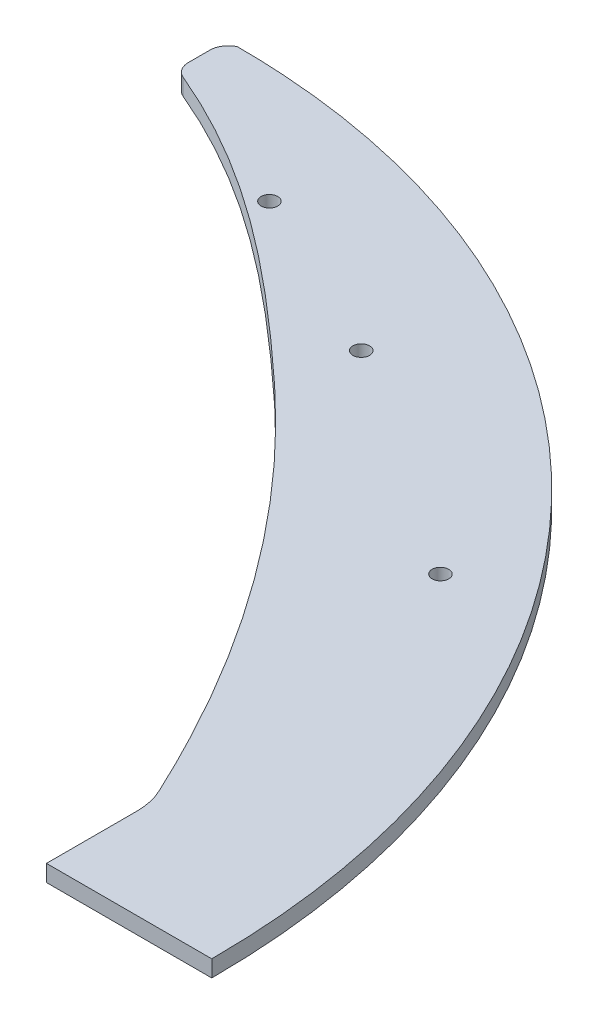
ISO-10303-21;
HEADER;
FILE_DESCRIPTION(('STEP AP214'),'2;1');
FILE_NAME('part.step','',(''),(''),'','','');
FILE_SCHEMA(('AUTOMOTIVE_DESIGN { 1 0 10303 214 1 1 1 1 }'));
ENDSEC;
DATA;
#1=APPLICATION_CONTEXT('core data for automotive mechanical design processes');
#2=APPLICATION_PROTOCOL_DEFINITION('international standard','automotive_design',2000,#1);
#3=PRODUCT_CONTEXT('',#1,'mechanical');
#4=PRODUCT('Part','Part','',(#3));
#5=PRODUCT_RELATED_PRODUCT_CATEGORY('part','',(#4));
#6=PRODUCT_DEFINITION_FORMATION('','',#4);
#7=PRODUCT_DEFINITION_CONTEXT('part definition',#1,'design');
#8=PRODUCT_DEFINITION('design','',#6,#7);
#9=PRODUCT_DEFINITION_SHAPE('','',#8);
#10=(LENGTH_UNIT() NAMED_UNIT(*) SI_UNIT(.MILLI.,.METRE.));
#11=(NAMED_UNIT(*) PLANE_ANGLE_UNIT() SI_UNIT($,.RADIAN.));
#12=(NAMED_UNIT(*) SI_UNIT($,.STERADIAN.) SOLID_ANGLE_UNIT());
#13=UNCERTAINTY_MEASURE_WITH_UNIT(LENGTH_MEASURE(1.E-05),#10,'distance_accuracy_value','');
#14=(GEOMETRIC_REPRESENTATION_CONTEXT(3) GLOBAL_UNCERTAINTY_ASSIGNED_CONTEXT((#13)) GLOBAL_UNIT_ASSIGNED_CONTEXT((#10,
#11,#12)) REPRESENTATION_CONTEXT('',''));
#15=CARTESIAN_POINT('',(0.,0.,0.));
#16=DIRECTION('',(0.,0.,1.));
#17=DIRECTION('',(1.,0.,0.));
#18=AXIS2_PLACEMENT_3D('',#15,#16,#17);
#19=CARTESIAN_POINT('',(-284.393197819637,6.35,-281.299037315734));
#20=CARTESIAN_POINT('',(-285.021622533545,6.35,-280.770880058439));
#21=CARTESIAN_POINT('',(-285.648490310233,6.35,-280.214344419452));
#22=CARTESIAN_POINT('',(-286.273725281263,6.35,-279.628692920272));
#23=B_SPLINE_CURVE_WITH_KNOTS('',3,(#19,#20,#21,#22),.UNSPECIFIED.,.F.,.F.,(4,4),
(0.923259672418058,0.930191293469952),.UNSPECIFIED.);
#24=DIRECTION('',(0.,-1.,0.));
#25=VECTOR('',#24,1.);
#26=SURFACE_OF_LINEAR_EXTRUSION('',#23,#25);
#27=CARTESIAN_POINT('',(-284.393197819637,0.,-281.299037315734));
#28=CARTESIAN_POINT('',(-285.021622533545,0.,-280.770880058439));
#29=CARTESIAN_POINT('',(-285.648490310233,0.,-280.214344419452));
#30=CARTESIAN_POINT('',(-286.273725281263,0.,-279.628692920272));
#31=B_SPLINE_CURVE_WITH_KNOTS('',3,(#27,#28,#29,#30),.UNSPECIFIED.,.F.,.F.,(4,4),
(0.923259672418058,0.930191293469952),.UNSPECIFIED.);
#32=CARTESIAN_POINT('',(-284.393197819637,0.,-281.299037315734));
#33=VERTEX_POINT('',#32);
#34=CARTESIAN_POINT('',(-286.273725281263,0.,-279.628692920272));
#35=VERTEX_POINT('',#34);
#36=EDGE_CURVE('E135',#33,#35,#31,.T.);
#37=ORIENTED_EDGE('',*,*,#36,.T.);
#38=DIRECTION('',(0.,-1.,0.));
#39=VECTOR('',#38,1.);
#40=CARTESIAN_POINT('',(-286.273725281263,6.35,-279.628692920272));
#41=LINE('',#40,#39);
#42=CARTESIAN_POINT('',(-286.273725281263,6.35,-279.628692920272));
#43=VERTEX_POINT('',#42);
#44=EDGE_CURVE('E11',#43,#35,#41,.T.);
#45=ORIENTED_EDGE('',*,*,#44,.F.);
#46=CARTESIAN_POINT('',(-284.393197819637,6.35,-281.299037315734));
#47=VERTEX_POINT('',#46);
#48=EDGE_CURVE('E173',#47,#43,#23,.T.);
#49=ORIENTED_EDGE('',*,*,#48,.F.);
#50=DIRECTION('',(0.,-1.,0.));
#51=VECTOR('',#50,1.);
#52=CARTESIAN_POINT('',(-284.393197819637,6.35,-281.299037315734));
#53=LINE('',#52,#51);
#54=EDGE_CURVE('E130',#47,#33,#53,.T.);
#55=ORIENTED_EDGE('',*,*,#54,.T.);
#56=EDGE_LOOP('',(#37,#45,#49,#55));
#57=FACE_BOUND('',#56,.T.);
#58=ADVANCED_FACE('F31',(#57),#26,.F.);
#59=CARTESIAN_POINT('',(-281.9326968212,6.35,-274.994259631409));
#60=DIRECTION('',(0.,-1.,0.));
#61=DIRECTION('',(0.,0.,-1.));
#62=AXIS2_PLACEMENT_3D('',#59,#60,#61);
#63=CYLINDRICAL_SURFACE('',#62,6.35);
#64=CARTESIAN_POINT('',(-281.9326968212,0.,-274.994259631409));
#65=DIRECTION('',(0.,1.,0.));
#66=DIRECTION('',(0.,0.,1.));
#67=AXIS2_PLACEMENT_3D('',#64,#65,#66);
#68=CIRCLE('',#67,6.35);
#69=CARTESIAN_POINT('',(-288.2826968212,0.,-274.994259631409));
#70=VERTEX_POINT('',#69);
#71=EDGE_CURVE('E238',#35,#70,#68,.T.);
#72=ORIENTED_EDGE('',*,*,#71,.T.);
#73=DIRECTION('',(0.,-1.,0.));
#74=VECTOR('',#73,1.);
#75=CARTESIAN_POINT('',(-288.2826968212,6.35,-274.994259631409));
#76=LINE('',#75,#74);
#77=CARTESIAN_POINT('',(-288.2826968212,6.35,-274.994259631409));
#78=VERTEX_POINT('',#77);
#79=EDGE_CURVE('E40',#78,#70,#76,.T.);
#80=ORIENTED_EDGE('',*,*,#79,.F.);
#81=CARTESIAN_POINT('',(-281.9326968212,6.35,-274.994259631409));
#82=DIRECTION('',(0.,1.,0.));
#83=DIRECTION('',(0.,0.,1.));
#84=AXIS2_PLACEMENT_3D('',#81,#82,#83);
#85=CIRCLE('',#84,6.35);
#86=EDGE_CURVE('E93',#43,#78,#85,.T.);
#87=ORIENTED_EDGE('',*,*,#86,.F.);
#88=ORIENTED_EDGE('',*,*,#44,.T.);
#89=EDGE_LOOP('',(#72,#80,#87,#88));
#90=FACE_BOUND('',#89,.T.);
#91=ADVANCED_FACE('F227',(#90),#63,.T.);
#92=CARTESIAN_POINT('',(-288.2826968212,6.35,-266.670639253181));
#93=DIRECTION('',(1.,0.,0.));
#94=DIRECTION('',(0.,0.,-1.));
#95=AXIS2_PLACEMENT_3D('',#92,#93,#94);
#96=PLANE('',#95);
#97=DIRECTION('',(0.,0.,1.));
#98=VECTOR('',#97,1.);
#99=CARTESIAN_POINT('',(-288.2826968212,0.,-266.670639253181));
#100=LINE('',#99,#98);
#101=CARTESIAN_POINT('',(-288.2826968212,0.,-266.670639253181));
#102=VERTEX_POINT('',#101);
#103=EDGE_CURVE('E239',#70,#102,#100,.T.);
#104=ORIENTED_EDGE('',*,*,#103,.T.);
#105=DIRECTION('',(0.,-1.,0.));
#106=VECTOR('',#105,1.);
#107=CARTESIAN_POINT('',(-288.2826968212,6.35,-266.670639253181));
#108=LINE('',#107,#106);
#109=CARTESIAN_POINT('',(-288.2826968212,6.35,-266.670639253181));
#110=VERTEX_POINT('',#109);
#111=EDGE_CURVE('E266',#110,#102,#108,.T.);
#112=ORIENTED_EDGE('',*,*,#111,.F.);
#113=DIRECTION('',(0.,0.,1.));
#114=VECTOR('',#113,1.);
#115=CARTESIAN_POINT('',(-288.2826968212,6.35,-266.670639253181));
#116=LINE('',#115,#114);
#117=EDGE_CURVE('E171',#78,#110,#116,.T.);
#118=ORIENTED_EDGE('',*,*,#117,.F.);
#119=ORIENTED_EDGE('',*,*,#79,.T.);
#120=EDGE_LOOP('',(#104,#112,#118,#119));
#121=FACE_BOUND('',#120,.T.);
#122=ADVANCED_FACE('F232',(#121),#96,.F.);
#123=CARTESIAN_POINT('',(-281.9326968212,6.35,-266.670639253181));
#124=DIRECTION('',(0.,-1.,0.));
#125=DIRECTION('',(0.,0.,-1.));
#126=AXIS2_PLACEMENT_3D('',#123,#124,#125);
#127=CYLINDRICAL_SURFACE('',#126,6.35);
#128=CARTESIAN_POINT('',(-281.9326968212,0.,-266.670639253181));
#129=DIRECTION('',(0.,1.,0.));
#130=DIRECTION('',(0.,0.,-1.));
#131=AXIS2_PLACEMENT_3D('',#128,#129,#130);
#132=CIRCLE('',#131,6.35);
#133=CARTESIAN_POINT('',(-284.393197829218,0.,-260.816714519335));
#134=VERTEX_POINT('',#133);
#135=EDGE_CURVE('E241',#102,#134,#132,.T.);
#136=ORIENTED_EDGE('',*,*,#135,.T.);
#137=DIRECTION('',(0.,-1.,0.));
#138=VECTOR('',#137,1.);
#139=CARTESIAN_POINT('',(-284.393197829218,6.35,-260.816714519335));
#140=LINE('',#139,#138);
#141=CARTESIAN_POINT('',(-284.393197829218,6.35,-260.816714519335));
#142=VERTEX_POINT('',#141);
#143=EDGE_CURVE('E263',#142,#134,#140,.T.);
#144=ORIENTED_EDGE('',*,*,#143,.F.);
#145=CARTESIAN_POINT('',(-281.9326968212,6.35,-266.670639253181));
#146=DIRECTION('',(0.,1.,0.));
#147=DIRECTION('',(0.,0.,-1.));
#148=AXIS2_PLACEMENT_3D('',#145,#146,#147);
#149=CIRCLE('',#148,6.35);
#150=EDGE_CURVE('E166',#110,#142,#149,.T.);
#151=ORIENTED_EDGE('',*,*,#150,.F.);
#152=ORIENTED_EDGE('',*,*,#111,.T.);
#153=EDGE_LOOP('',(#136,#144,#151,#152));
#154=FACE_BOUND('',#153,.T.);
#155=ADVANCED_FACE('F158',(#154),#127,.T.);
#156=CARTESIAN_POINT('',(-284.393197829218,6.35,-260.816714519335));
#157=CARTESIAN_POINT('',(-243.72979105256,6.35,-243.725214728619));
#158=CARTESIAN_POINT('',(-201.534298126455,6.35,-210.049484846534));
#159=CARTESIAN_POINT('',(-119.663104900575,6.35,-134.815986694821));
#160=CARTESIAN_POINT('',(-79.099570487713,6.35,-76.2755602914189));
#161=CARTESIAN_POINT('',(-52.7979241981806,6.35,-19.9194328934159));
#162=B_SPLINE_CURVE_WITH_KNOTS('',3,(#156,#157,#158,#159,#160,#161),.UNSPECIFIED.,.F.,.F.,(4,1,
1,4),(0.0154528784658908,0.380289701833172,0.477654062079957,0.989096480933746),.UNSPECIFIED.);
#163=DIRECTION('',(0.,-1.,0.));
#164=VECTOR('',#163,1.);
#165=SURFACE_OF_LINEAR_EXTRUSION('',#162,#164);
#166=CARTESIAN_POINT('',(-284.393197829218,0.,-260.816714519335));
#167=CARTESIAN_POINT('',(-243.72979105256,0.,-243.725214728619));
#168=CARTESIAN_POINT('',(-201.534298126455,0.,-210.049484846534));
#169=CARTESIAN_POINT('',(-119.663104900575,0.,-134.815986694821));
#170=CARTESIAN_POINT('',(-79.099570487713,0.,-76.2755602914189));
#171=CARTESIAN_POINT('',(-52.7979241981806,0.,-19.9194328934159));
#172=B_SPLINE_CURVE_WITH_KNOTS('',3,(#166,#167,#168,#169,#170,#171),.UNSPECIFIED.,.F.,.F.,(4,1,
1,4),(0.0154528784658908,0.380289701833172,0.477654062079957,0.989096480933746),.UNSPECIFIED.);
#173=CARTESIAN_POINT('',(-52.7979241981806,0.,-19.9194328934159));
#174=VERTEX_POINT('',#173);
#175=EDGE_CURVE('E245',#134,#174,#172,.T.);
#176=ORIENTED_EDGE('',*,*,#175,.T.);
#177=DIRECTION('',(0.,-1.,0.));
#178=VECTOR('',#177,1.);
#179=CARTESIAN_POINT('',(-52.7979241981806,6.35,-19.9194328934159));
#180=LINE('',#179,#178);
#181=CARTESIAN_POINT('',(-52.7979241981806,6.35,-19.9194328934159));
#182=VERTEX_POINT('',#181);
#183=EDGE_CURVE('E260',#182,#174,#180,.T.);
#184=ORIENTED_EDGE('',*,*,#183,.F.);
#185=EDGE_CURVE('E161',#142,#182,#162,.T.);
#186=ORIENTED_EDGE('',*,*,#185,.F.);
#187=ORIENTED_EDGE('',*,*,#143,.T.);
#188=EDGE_LOOP('',(#176,#184,#186,#187));
#189=FACE_BOUND('',#188,.T.);
#190=ADVANCED_FACE('F153',(#189),#165,.F.);
#191=CARTESIAN_POINT('',(-75.8146441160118,6.35,-9.17743102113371));
#192=DIRECTION('',(0.,-1.,0.));
#193=DIRECTION('',(0.,0.,-1.));
#194=AXIS2_PLACEMENT_3D('',#191,#192,#193);
#195=CYLINDRICAL_SURFACE('',#194,25.4);
#196=CARTESIAN_POINT('',(-75.8146441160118,0.,-9.17743102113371));
#197=DIRECTION('',(0.,-1.,0.));
#198=DIRECTION('',(0.,0.,1.));
#199=AXIS2_PLACEMENT_3D('',#196,#197,#198);
#200=CIRCLE('',#199,25.4);
#201=CARTESIAN_POINT('',(-50.4146441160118,0.,-9.17743102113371));
#202=VERTEX_POINT('',#201);
#203=EDGE_CURVE('E249',#174,#202,#200,.T.);
#204=ORIENTED_EDGE('',*,*,#203,.T.);
#205=DIRECTION('',(0.,-1.,0.));
#206=VECTOR('',#205,1.);
#207=CARTESIAN_POINT('',(-50.4146441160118,6.35,-9.17743102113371));
#208=LINE('',#207,#206);
#209=CARTESIAN_POINT('',(-50.4146441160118,6.35,-9.17743102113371));
#210=VERTEX_POINT('',#209);
#211=EDGE_CURVE('E125',#210,#202,#208,.T.);
#212=ORIENTED_EDGE('',*,*,#211,.F.);
#213=CARTESIAN_POINT('',(-75.8146441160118,6.35,-9.17743102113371));
#214=DIRECTION('',(0.,-1.,0.));
#215=DIRECTION('',(0.,0.,1.));
#216=AXIS2_PLACEMENT_3D('',#213,#214,#215);
#217=CIRCLE('',#216,25.4);
#218=EDGE_CURVE('E115',#182,#210,#217,.T.);
#219=ORIENTED_EDGE('',*,*,#218,.F.);
#220=ORIENTED_EDGE('',*,*,#183,.T.);
#221=EDGE_LOOP('',(#204,#212,#219,#220));
#222=FACE_BOUND('',#221,.T.);
#223=ADVANCED_FACE('F150',(#222),#195,.F.);
#224=CARTESIAN_POINT('',(-50.4146441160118,6.35,-9.17743102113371));
#225=DIRECTION('',(1.,0.,0.));
#226=DIRECTION('',(0.,0.,-1.));
#227=AXIS2_PLACEMENT_3D('',#224,#225,#226);
#228=PLANE('',#227);
#229=DIRECTION('',(0.,0.,1.));
#230=VECTOR('',#229,1.);
#231=CARTESIAN_POINT('',(-50.4146441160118,0.,-9.17743102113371));
#232=LINE('',#231,#230);
#233=CARTESIAN_POINT('',(-50.4146441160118,0.,25.403057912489));
#234=VERTEX_POINT('',#233);
#235=EDGE_CURVE('E124',#202,#234,#232,.T.);
#236=ORIENTED_EDGE('',*,*,#235,.T.);
#237=DIRECTION('',(0.,-1.,0.));
#238=VECTOR('',#237,1.);
#239=CARTESIAN_POINT('',(-50.4146441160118,6.35,25.403057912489));
#240=LINE('',#239,#238);
#241=CARTESIAN_POINT('',(-50.4146441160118,6.35,25.403057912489));
#242=VERTEX_POINT('',#241);
#243=EDGE_CURVE('E121',#242,#234,#240,.T.);
#244=ORIENTED_EDGE('',*,*,#243,.F.);
#245=DIRECTION('',(0.,0.,1.));
#246=VECTOR('',#245,1.);
#247=CARTESIAN_POINT('',(-50.4146441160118,6.35,-9.17743102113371));
#248=LINE('',#247,#246);
#249=EDGE_CURVE('E109',#210,#242,#248,.T.);
#250=ORIENTED_EDGE('',*,*,#249,.F.);
#251=ORIENTED_EDGE('',*,*,#211,.T.);
#252=EDGE_LOOP('',(#236,#244,#250,#251));
#253=FACE_BOUND('',#252,.T.);
#254=ADVANCED_FACE('F122',(#253),#228,.F.);
#255=CARTESIAN_POINT('',(-12.6572245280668,6.35,25.403057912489));
#256=DIRECTION('',(0.,0.,-1.));
#257=DIRECTION('',(-1.,0.,0.));
#258=AXIS2_PLACEMENT_3D('',#255,#256,#257);
#259=PLANE('',#258);
#260=DIRECTION('',(1.,0.,0.));
#261=VECTOR('',#260,1.);
#262=CARTESIAN_POINT('',(-12.6572245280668,0.,25.403057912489));
#263=LINE('',#262,#261);
#264=CARTESIAN_POINT('',(12.7501824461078,0.,25.403057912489));
#265=VERTEX_POINT('',#264);
#266=EDGE_CURVE('E79',#234,#265,#263,.T.);
#267=ORIENTED_EDGE('',*,*,#266,.T.);
#268=DIRECTION('',(0.,-1.,0.));
#269=VECTOR('',#268,1.);
#270=CARTESIAN_POINT('',(12.7501824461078,6.35,25.403057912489));
#271=LINE('',#270,#269);
#272=CARTESIAN_POINT('',(12.7501824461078,6.35,25.403057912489));
#273=VERTEX_POINT('',#272);
#274=EDGE_CURVE('E126',#273,#265,#271,.T.);
#275=ORIENTED_EDGE('',*,*,#274,.F.);
#276=DIRECTION('',(1.,0.,0.));
#277=VECTOR('',#276,1.);
#278=CARTESIAN_POINT('',(-50.4146441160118,6.35,25.403057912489));
#279=LINE('',#278,#277);
#280=EDGE_CURVE('E113',#242,#273,#279,.T.);
#281=ORIENTED_EDGE('',*,*,#280,.F.);
#282=ORIENTED_EDGE('',*,*,#243,.T.);
#283=EDGE_LOOP('',(#267,#275,#281,#282));
#284=FACE_BOUND('',#283,.T.);
#285=ADVANCED_FACE('F128',(#284),#259,.F.);
#286=CARTESIAN_POINT('',(-284.393197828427,6.35,25.4030579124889));
#287=DIRECTION('',(0.,1.,0.));
#288=DIRECTION('',(0.,0.,-1.));
#289=AXIS2_PLACEMENT_3D('',#286,#287,#288);
#290=ELLIPSE('',#289,306.702095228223,297.143380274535);
#291=DIRECTION('',(0.,-1.,0.));
#292=VECTOR('',#291,1.);
#293=SURFACE_OF_LINEAR_EXTRUSION('',#290,#292);
#294=CARTESIAN_POINT('',(-284.393197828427,0.,25.4030579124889));
#295=DIRECTION('',(0.,1.,0.));
#296=DIRECTION('',(0.,0.,-1.));
#297=AXIS2_PLACEMENT_3D('',#294,#295,#296);
#298=ELLIPSE('',#297,306.702095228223,297.143380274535);
#299=EDGE_CURVE('E85',#265,#33,#298,.T.);
#300=ORIENTED_EDGE('',*,*,#299,.T.);
#301=ORIENTED_EDGE('',*,*,#54,.F.);
#302=EDGE_CURVE('E48',#273,#47,#290,.T.);
#303=ORIENTED_EDGE('',*,*,#302,.F.);
#304=ORIENTED_EDGE('',*,*,#274,.T.);
#305=EDGE_LOOP('',(#300,#301,#303,#304));
#306=FACE_BOUND('',#305,.T.);
#307=ADVANCED_FACE('F140',(#306),#293,.F.);
#308=CARTESIAN_POINT('',(-285.334657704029,6.35,-280.48542545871));
#309=DIRECTION('',(0.,-1.,0.));
#310=DIRECTION('',(0.,0.,-1.));
#311=AXIS2_PLACEMENT_3D('',#308,#309,#310);
#312=PLANE('',#311);
#313=CARTESIAN_POINT('',(-226.891855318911,6.35,-236.255776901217));
#314=DIRECTION('',(0.,1.,0.));
#315=DIRECTION('',(0.,0.,1.));
#316=AXIS2_PLACEMENT_3D('',#313,#314,#315);
#317=CIRCLE('',#316,3.18135000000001);
#318=CARTESIAN_POINT('',(-226.891855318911,6.35,-233.074426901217));
#319=VERTEX_POINT('',#318);
#320=EDGE_CURVE('E194',#319,#319,#317,.T.);
#321=ORIENTED_EDGE('',*,*,#320,.F.);
#322=EDGE_LOOP('',(#321));
#323=FACE_BOUND('',#322,.T.);
#324=CARTESIAN_POINT('',(-159.936390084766,6.35,-204.38643865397));
#325=DIRECTION('',(0.,1.,0.));
#326=DIRECTION('',(0.,0.,1.));
#327=AXIS2_PLACEMENT_3D('',#324,#325,#326);
#328=CIRCLE('',#327,3.18135000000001);
#329=CARTESIAN_POINT('',(-159.936390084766,6.35,-201.20508865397));
#330=VERTEX_POINT('',#329);
#331=EDGE_CURVE('E188',#330,#330,#328,.T.);
#332=ORIENTED_EDGE('',*,*,#331,.F.);
#333=EDGE_LOOP('',(#332));
#334=FACE_BOUND('',#333,.T.);
#335=CARTESIAN_POINT('',(-70.8638343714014,6.35,-145.5785908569));
#336=DIRECTION('',(0.,1.,0.));
#337=DIRECTION('',(0.,0.,1.));
#338=AXIS2_PLACEMENT_3D('',#335,#336,#337);
#339=CIRCLE('',#338,3.18135);
#340=CARTESIAN_POINT('',(-70.8638343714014,6.35,-142.3972408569));
#341=VERTEX_POINT('',#340);
#342=EDGE_CURVE('E178',#341,#341,#339,.T.);
#343=ORIENTED_EDGE('',*,*,#342,.F.);
#344=EDGE_LOOP('',(#343));
#345=FACE_BOUND('',#344,.T.);
#346=ORIENTED_EDGE('',*,*,#48,.T.);
#347=ORIENTED_EDGE('',*,*,#86,.T.);
#348=ORIENTED_EDGE('',*,*,#117,.T.);
#349=ORIENTED_EDGE('',*,*,#150,.T.);
#350=ORIENTED_EDGE('',*,*,#185,.T.);
#351=ORIENTED_EDGE('',*,*,#218,.T.);
#352=ORIENTED_EDGE('',*,*,#249,.T.);
#353=ORIENTED_EDGE('',*,*,#280,.T.);
#354=ORIENTED_EDGE('',*,*,#302,.T.);
#355=EDGE_LOOP('',(#346,#347,#348,#349,#350,#351,#352,#353,#354));
#356=FACE_BOUND('',#355,.T.);
#357=ADVANCED_FACE('F111',(#323,#334,#345,#356),#312,.F.);
#358=CARTESIAN_POINT('',(-285.334657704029,0.,-280.48542545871));
#359=DIRECTION('',(0.,-1.,0.));
#360=DIRECTION('',(0.,0.,-1.));
#361=AXIS2_PLACEMENT_3D('',#358,#359,#360);
#362=PLANE('',#361);
#363=CARTESIAN_POINT('',(-226.891855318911,0.,-236.255776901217));
#364=DIRECTION('',(0.,1.,0.));
#365=DIRECTION('',(0.,0.,1.));
#366=AXIS2_PLACEMENT_3D('',#363,#364,#365);
#367=CIRCLE('',#366,3.18135000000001);
#368=CARTESIAN_POINT('',(-226.891855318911,0.,-233.074426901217));
#369=VERTEX_POINT('',#368);
#370=EDGE_CURVE('E191',#369,#369,#367,.T.);
#371=ORIENTED_EDGE('',*,*,#370,.T.);
#372=EDGE_LOOP('',(#371));
#373=FACE_BOUND('',#372,.T.);
#374=CARTESIAN_POINT('',(-159.936390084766,0.,-204.38643865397));
#375=DIRECTION('',(0.,1.,0.));
#376=DIRECTION('',(0.,0.,1.));
#377=AXIS2_PLACEMENT_3D('',#374,#375,#376);
#378=CIRCLE('',#377,3.18135000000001);
#379=CARTESIAN_POINT('',(-159.936390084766,0.,-201.20508865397));
#380=VERTEX_POINT('',#379);
#381=EDGE_CURVE('E185',#380,#380,#378,.T.);
#382=ORIENTED_EDGE('',*,*,#381,.T.);
#383=EDGE_LOOP('',(#382));
#384=FACE_BOUND('',#383,.T.);
#385=CARTESIAN_POINT('',(-70.8638343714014,0.,-145.5785908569));
#386=DIRECTION('',(0.,1.,0.));
#387=DIRECTION('',(0.,0.,1.));
#388=AXIS2_PLACEMENT_3D('',#385,#386,#387);
#389=CIRCLE('',#388,3.18135);
#390=CARTESIAN_POINT('',(-70.8638343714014,0.,-142.3972408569));
#391=VERTEX_POINT('',#390);
#392=EDGE_CURVE('E184',#391,#391,#389,.T.);
#393=ORIENTED_EDGE('',*,*,#392,.T.);
#394=EDGE_LOOP('',(#393));
#395=FACE_BOUND('',#394,.T.);
#396=ORIENTED_EDGE('',*,*,#36,.F.);
#397=ORIENTED_EDGE('',*,*,#299,.F.);
#398=ORIENTED_EDGE('',*,*,#266,.F.);
#399=ORIENTED_EDGE('',*,*,#235,.F.);
#400=ORIENTED_EDGE('',*,*,#203,.F.);
#401=ORIENTED_EDGE('',*,*,#175,.F.);
#402=ORIENTED_EDGE('',*,*,#135,.F.);
#403=ORIENTED_EDGE('',*,*,#103,.F.);
#404=ORIENTED_EDGE('',*,*,#71,.F.);
#405=EDGE_LOOP('',(#396,#397,#398,#399,#400,#401,#402,#403,#404));
#406=FACE_BOUND('',#405,.T.);
#407=ADVANCED_FACE('F144',(#373,#384,#395,#406),#362,.T.);
#408=CARTESIAN_POINT('',(-70.8638343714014,0.,-145.5785908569));
#409=DIRECTION('',(0.,1.,0.));
#410=DIRECTION('',(0.,0.,1.));
#411=AXIS2_PLACEMENT_3D('',#408,#409,#410);
#412=CYLINDRICAL_SURFACE('',#411,3.18135);
#413=ORIENTED_EDGE('',*,*,#392,.F.);
#414=EDGE_LOOP('',(#413));
#415=FACE_BOUND('',#414,.T.);
#416=ORIENTED_EDGE('',*,*,#342,.T.);
#417=EDGE_LOOP('',(#416));
#418=FACE_BOUND('',#417,.T.);
#419=ADVANCED_FACE('F215',(#415,#418),#412,.F.);
#420=CARTESIAN_POINT('',(-159.936390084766,0.,-204.38643865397));
#421=DIRECTION('',(0.,1.,0.));
#422=DIRECTION('',(0.,0.,1.));
#423=AXIS2_PLACEMENT_3D('',#420,#421,#422);
#424=CYLINDRICAL_SURFACE('',#423,3.18135000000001);
#425=ORIENTED_EDGE('',*,*,#381,.F.);
#426=EDGE_LOOP('',(#425));
#427=FACE_BOUND('',#426,.T.);
#428=ORIENTED_EDGE('',*,*,#331,.T.);
#429=EDGE_LOOP('',(#428));
#430=FACE_BOUND('',#429,.T.);
#431=ADVANCED_FACE('F205',(#427,#430),#424,.F.);
#432=CARTESIAN_POINT('',(-226.891855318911,0.,-236.255776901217));
#433=DIRECTION('',(0.,1.,0.));
#434=DIRECTION('',(0.,0.,1.));
#435=AXIS2_PLACEMENT_3D('',#432,#433,#434);
#436=CYLINDRICAL_SURFACE('',#435,3.18135000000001);
#437=ORIENTED_EDGE('',*,*,#370,.F.);
#438=EDGE_LOOP('',(#437));
#439=FACE_BOUND('',#438,.T.);
#440=ORIENTED_EDGE('',*,*,#320,.T.);
#441=EDGE_LOOP('',(#440));
#442=FACE_BOUND('',#441,.T.);
#443=ADVANCED_FACE('F202',(#439,#442),#436,.F.);
#444=CLOSED_SHELL('',(#58,#91,#122,#155,#190,#223,#254,#285,#307,#357,#407,#419,#431,#443));
#445=MANIFOLD_SOLID_BREP('B2',#444);
#446=ADVANCED_BREP_SHAPE_REPRESENTATION('',(#18,#445),#14);
#447=SHAPE_DEFINITION_REPRESENTATION(#9,#446);
ENDSEC;
END-ISO-10303-21;
